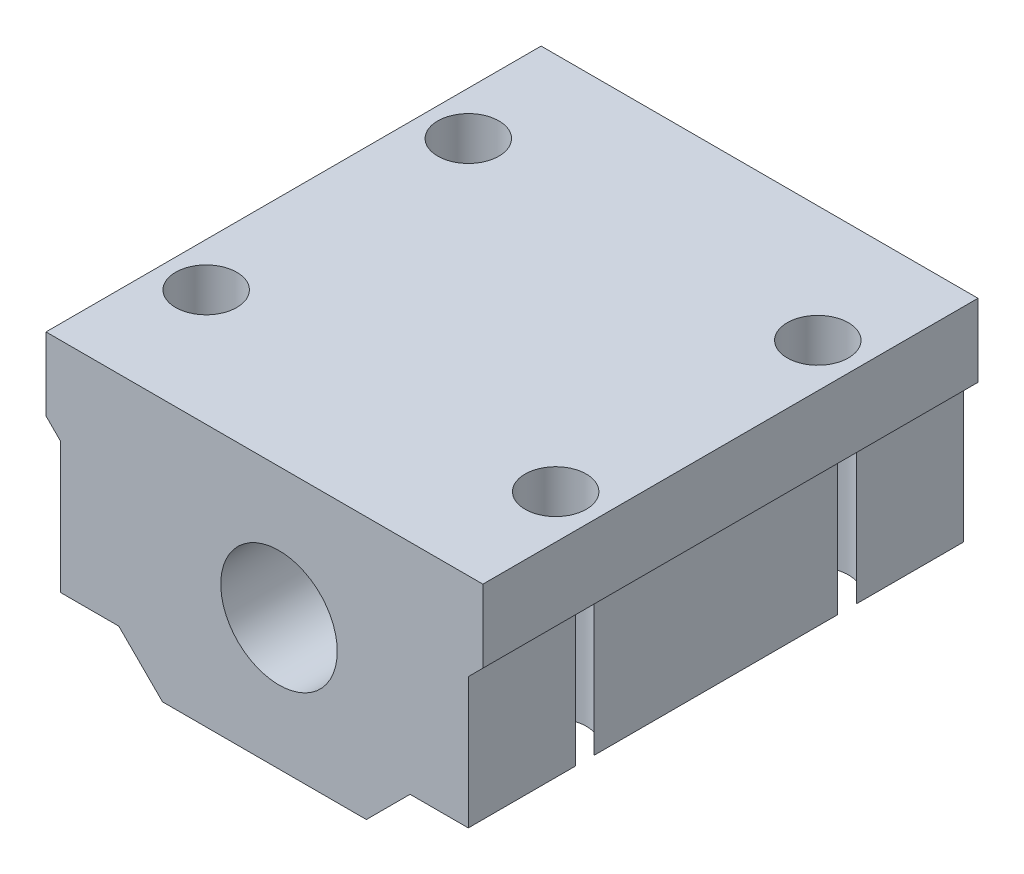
ISO-10303-21;
HEADER;
FILE_DESCRIPTION(('STEP AP214'),'2;1');
FILE_NAME('part.step','',(''),(''),'','','');
FILE_SCHEMA(('AUTOMOTIVE_DESIGN { 1 0 10303 214 1 1 1 1 }'));
ENDSEC;
DATA;
#1=APPLICATION_CONTEXT('core data for automotive mechanical design processes');
#2=APPLICATION_PROTOCOL_DEFINITION('international standard','automotive_design',2000,#1);
#3=PRODUCT_CONTEXT('',#1,'mechanical');
#4=PRODUCT('Part','Part','',(#3));
#5=PRODUCT_RELATED_PRODUCT_CATEGORY('part','',(#4));
#6=PRODUCT_DEFINITION_FORMATION('','',#4);
#7=PRODUCT_DEFINITION_CONTEXT('part definition',#1,'design');
#8=PRODUCT_DEFINITION('design','',#6,#7);
#9=PRODUCT_DEFINITION_SHAPE('','',#8);
#10=(LENGTH_UNIT() NAMED_UNIT(*) SI_UNIT(.MILLI.,.METRE.));
#11=(NAMED_UNIT(*) PLANE_ANGLE_UNIT() SI_UNIT($,.RADIAN.));
#12=(NAMED_UNIT(*) SI_UNIT($,.STERADIAN.) SOLID_ANGLE_UNIT());
#13=UNCERTAINTY_MEASURE_WITH_UNIT(LENGTH_MEASURE(1.E-05),#10,'distance_accuracy_value','');
#14=(GEOMETRIC_REPRESENTATION_CONTEXT(3) GLOBAL_UNCERTAINTY_ASSIGNED_CONTEXT((#13)) GLOBAL_UNIT_ASSIGNED_CONTEXT((#10,
#11,#12)) REPRESENTATION_CONTEXT('',''));
#15=CARTESIAN_POINT('',(0.,0.,0.));
#16=DIRECTION('',(0.,0.,1.));
#17=DIRECTION('',(1.,0.,0.));
#18=AXIS2_PLACEMENT_3D('',#15,#16,#17);
#19=CARTESIAN_POINT('',(0.,-6.,34.));
#20=DIRECTION('',(0.,1.,0.));
#21=DIRECTION('',(-1.,0.,0.));
#22=AXIS2_PLACEMENT_3D('',#19,#20,#21);
#23=PLANE('',#22);
#24=DIRECTION('',(0.,0.,-1.));
#25=VECTOR('',#24,1.);
#26=CARTESIAN_POINT('',(9.,-6.,34.));
#27=LINE('',#26,#25);
#28=CARTESIAN_POINT('',(9.,-6.,34.));
#29=VERTEX_POINT('',#28);
#30=CARTESIAN_POINT('',(9.,-6.,26.6403124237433));
#31=VERTEX_POINT('',#30);
#32=EDGE_CURVE('E212',#29,#31,#27,.T.);
#33=ORIENTED_EDGE('',*,*,#32,.T.);
#34=CARTESIAN_POINT('',(11.,-6.,26.));
#35=DIRECTION('',(0.,1.,0.));
#36=DIRECTION('',(-1.,0.,0.));
#37=AXIS2_PLACEMENT_3D('',#34,#35,#36);
#38=CIRCLE('',#37,2.1);
#39=CARTESIAN_POINT('',(13.,-6.,26.6403124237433));
#40=VERTEX_POINT('',#39);
#41=EDGE_CURVE('E51',#31,#40,#38,.T.);
#42=ORIENTED_EDGE('',*,*,#41,.T.);
#43=DIRECTION('',(0.,0.,-1.));
#44=VECTOR('',#43,1.);
#45=CARTESIAN_POINT('',(13.,-6.,34.));
#46=LINE('',#45,#44);
#47=CARTESIAN_POINT('',(13.,-6.,34.));
#48=VERTEX_POINT('',#47);
#49=EDGE_CURVE('E216',#48,#40,#46,.T.);
#50=ORIENTED_EDGE('',*,*,#49,.F.);
#51=DIRECTION('',(1.,0.,0.));
#52=VECTOR('',#51,1.);
#53=CARTESIAN_POINT('',(0.,-6.,34.));
#54=LINE('',#53,#52);
#55=EDGE_CURVE('E333',#29,#48,#54,.T.);
#56=ORIENTED_EDGE('',*,*,#55,.F.);
#57=EDGE_LOOP('',(#33,#42,#50,#56));
#58=FACE_BOUND('',#57,.T.);
#59=ADVANCED_FACE('F37',(#58),#23,.F.);
#60=CARTESIAN_POINT('',(13.,0.,34.));
#61=DIRECTION('',(1.,0.,0.));
#62=DIRECTION('',(0.,1.,0.));
#63=AXIS2_PLACEMENT_3D('',#60,#61,#62);
#64=PLANE('',#63);
#65=DIRECTION('',(0.,1.,0.));
#66=VECTOR('',#65,1.);
#67=CARTESIAN_POINT('',(13.,-9.,25.3596875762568));
#68=LINE('',#67,#66);
#69=CARTESIAN_POINT('',(13.,-6.,25.3596875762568));
#70=VERTEX_POINT('',#69);
#71=CARTESIAN_POINT('',(13.,3.,25.3596875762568));
#72=VERTEX_POINT('',#71);
#73=EDGE_CURVE('E397',#70,#72,#68,.T.);
#74=ORIENTED_EDGE('',*,*,#73,.F.);
#75=CARTESIAN_POINT('',(13.,-6.,8.64031242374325));
#76=VERTEX_POINT('',#75);
#77=EDGE_CURVE('E207',#70,#76,#46,.T.);
#78=ORIENTED_EDGE('',*,*,#77,.T.);
#79=DIRECTION('',(0.,1.,0.));
#80=VECTOR('',#79,1.);
#81=CARTESIAN_POINT('',(13.,-9.,8.64031242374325));
#82=LINE('',#81,#80);
#83=CARTESIAN_POINT('',(13.,3.,8.64031242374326));
#84=VERTEX_POINT('',#83);
#85=EDGE_CURVE('E265',#84,#76,#82,.F.);
#86=ORIENTED_EDGE('',*,*,#85,.F.);
#87=DIRECTION('',(0.,0.,-1.));
#88=VECTOR('',#87,1.);
#89=CARTESIAN_POINT('',(13.,3.,34.));
#90=LINE('',#89,#88);
#91=EDGE_CURVE('E252',#72,#84,#90,.T.);
#92=ORIENTED_EDGE('',*,*,#91,.F.);
#93=EDGE_LOOP('',(#74,#78,#86,#92));
#94=FACE_BOUND('',#93,.T.);
#95=ADVANCED_FACE('F410',(#94),#64,.T.);
#96=DIRECTION('',(0.,1.,0.));
#97=VECTOR('',#96,1.);
#98=CARTESIAN_POINT('',(13.,-9.,7.35968757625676));
#99=LINE('',#98,#97);
#100=CARTESIAN_POINT('',(13.,-6.,7.35968757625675));
#101=VERTEX_POINT('',#100);
#102=CARTESIAN_POINT('',(13.,3.,7.35968757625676));
#103=VERTEX_POINT('',#102);
#104=EDGE_CURVE('E275',#101,#103,#99,.T.);
#105=ORIENTED_EDGE('',*,*,#104,.F.);
#106=CARTESIAN_POINT('',(13.,-6.,0.));
#107=VERTEX_POINT('',#106);
#108=EDGE_CURVE('E379',#101,#107,#46,.T.);
#109=ORIENTED_EDGE('',*,*,#108,.T.);
#110=DIRECTION('',(0.,-1.,0.));
#111=VECTOR('',#110,1.);
#112=CARTESIAN_POINT('',(13.,0.,0.));
#113=LINE('',#112,#111);
#114=CARTESIAN_POINT('',(13.,3.,0.));
#115=VERTEX_POINT('',#114);
#116=EDGE_CURVE('E343',#115,#107,#113,.T.);
#117=ORIENTED_EDGE('',*,*,#116,.F.);
#118=EDGE_CURVE('E247',#103,#115,#90,.T.);
#119=ORIENTED_EDGE('',*,*,#118,.F.);
#120=EDGE_LOOP('',(#105,#109,#117,#119));
#121=FACE_BOUND('',#120,.T.);
#122=ADVANCED_FACE('F386',(#121),#64,.T.);
#123=ORIENTED_EDGE('',*,*,#77,.F.);
#124=CARTESIAN_POINT('',(9.,-6.,25.3596875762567));
#125=VERTEX_POINT('',#124);
#126=EDGE_CURVE('E197',#70,#125,#38,.T.);
#127=ORIENTED_EDGE('',*,*,#126,.T.);
#128=CARTESIAN_POINT('',(9.,-6.,8.64031242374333));
#129=VERTEX_POINT('',#128);
#130=EDGE_CURVE('E206',#125,#129,#27,.T.);
#131=ORIENTED_EDGE('',*,*,#130,.T.);
#132=CARTESIAN_POINT('',(11.,-6.,8.));
#133=DIRECTION('',(0.,1.,0.));
#134=DIRECTION('',(-1.,0.,0.));
#135=AXIS2_PLACEMENT_3D('',#132,#133,#134);
#136=CIRCLE('',#135,2.1);
#137=EDGE_CURVE('E45',#129,#76,#136,.T.);
#138=ORIENTED_EDGE('',*,*,#137,.T.);
#139=EDGE_LOOP('',(#123,#127,#131,#138));
#140=FACE_BOUND('',#139,.T.);
#141=ADVANCED_FACE('F204',(#140),#23,.F.);
#142=DIRECTION('',(0.,0.,-1.));
#143=VECTOR('',#142,1.);
#144=CARTESIAN_POINT('',(-15.,-6.,34.));
#145=LINE('',#144,#143);
#146=CARTESIAN_POINT('',(-15.,-6.,34.));
#147=VERTEX_POINT('',#146);
#148=CARTESIAN_POINT('',(-15.,-6.,26.6403124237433));
#149=VERTEX_POINT('',#148);
#150=EDGE_CURVE('E230',#147,#149,#145,.T.);
#151=ORIENTED_EDGE('',*,*,#150,.T.);
#152=CARTESIAN_POINT('',(-13.,-6.,26.));
#153=DIRECTION('',(0.,1.,0.));
#154=DIRECTION('',(-1.,0.,0.));
#155=AXIS2_PLACEMENT_3D('',#152,#153,#154);
#156=CIRCLE('',#155,2.1);
#157=CARTESIAN_POINT('',(-11.,-6.,26.6403124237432));
#158=VERTEX_POINT('',#157);
#159=EDGE_CURVE('E281',#149,#158,#156,.T.);
#160=ORIENTED_EDGE('',*,*,#159,.T.);
#161=DIRECTION('',(0.,0.,-1.));
#162=VECTOR('',#161,1.);
#163=CARTESIAN_POINT('',(-11.,-6.,34.));
#164=LINE('',#163,#162);
#165=CARTESIAN_POINT('',(-11.,-6.,34.));
#166=VERTEX_POINT('',#165);
#167=EDGE_CURVE('E225',#166,#158,#164,.T.);
#168=ORIENTED_EDGE('',*,*,#167,.F.);
#169=EDGE_CURVE('E329',#147,#166,#54,.T.);
#170=ORIENTED_EDGE('',*,*,#169,.F.);
#171=EDGE_LOOP('',(#151,#160,#168,#170));
#172=FACE_BOUND('',#171,.T.);
#173=ADVANCED_FACE('F428',(#172),#23,.F.);
#174=CARTESIAN_POINT('',(-15.,0.,34.));
#175=DIRECTION('',(1.,0.,0.));
#176=DIRECTION('',(0.,1.,0.));
#177=AXIS2_PLACEMENT_3D('',#174,#175,#176);
#178=PLANE('',#177);
#179=CARTESIAN_POINT('',(-15.,-6.,25.3596875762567));
#180=VERTEX_POINT('',#179);
#181=CARTESIAN_POINT('',(-15.,-6.,8.64031242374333));
#182=VERTEX_POINT('',#181);
#183=EDGE_CURVE('E234',#180,#182,#145,.T.);
#184=ORIENTED_EDGE('',*,*,#183,.F.);
#185=DIRECTION('',(0.,1.,0.));
#186=VECTOR('',#185,1.);
#187=CARTESIAN_POINT('',(-15.,-9.,25.3596875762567));
#188=LINE('',#187,#186);
#189=CARTESIAN_POINT('',(-15.,3.,25.3596875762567));
#190=VERTEX_POINT('',#189);
#191=EDGE_CURVE('E285',#180,#190,#188,.T.);
#192=ORIENTED_EDGE('',*,*,#191,.T.);
#193=DIRECTION('',(0.,0.,-1.));
#194=VECTOR('',#193,1.);
#195=CARTESIAN_POINT('',(-15.,3.,34.));
#196=LINE('',#195,#194);
#197=CARTESIAN_POINT('',(-15.,3.,8.64031242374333));
#198=VERTEX_POINT('',#197);
#199=EDGE_CURVE('E239',#190,#198,#196,.T.);
#200=ORIENTED_EDGE('',*,*,#199,.T.);
#201=DIRECTION('',(0.,1.,0.));
#202=VECTOR('',#201,1.);
#203=CARTESIAN_POINT('',(-15.,-9.,8.64031242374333));
#204=LINE('',#203,#202);
#205=EDGE_CURVE('E297',#198,#182,#204,.F.);
#206=ORIENTED_EDGE('',*,*,#205,.T.);
#207=EDGE_LOOP('',(#184,#192,#200,#206));
#208=FACE_BOUND('',#207,.T.);
#209=ADVANCED_FACE('F432',(#208),#178,.F.);
#210=CARTESIAN_POINT('',(-15.,-6.,7.35968757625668));
#211=VERTEX_POINT('',#210);
#212=CARTESIAN_POINT('',(-15.,-6.,0.));
#213=VERTEX_POINT('',#212);
#214=EDGE_CURVE('E228',#211,#213,#145,.T.);
#215=ORIENTED_EDGE('',*,*,#214,.F.);
#216=DIRECTION('',(0.,1.,0.));
#217=VECTOR('',#216,1.);
#218=CARTESIAN_POINT('',(-15.,-9.,7.35968757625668));
#219=LINE('',#218,#217);
#220=CARTESIAN_POINT('',(-15.,3.,7.35968757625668));
#221=VERTEX_POINT('',#220);
#222=EDGE_CURVE('E300',#211,#221,#219,.T.);
#223=ORIENTED_EDGE('',*,*,#222,.T.);
#224=CARTESIAN_POINT('',(-15.,3.,0.));
#225=VERTEX_POINT('',#224);
#226=EDGE_CURVE('E233',#221,#225,#196,.T.);
#227=ORIENTED_EDGE('',*,*,#226,.T.);
#228=DIRECTION('',(0.,-1.,0.));
#229=VECTOR('',#228,1.);
#230=CARTESIAN_POINT('',(-15.,0.,0.));
#231=LINE('',#230,#229);
#232=EDGE_CURVE('E361',#225,#213,#231,.T.);
#233=ORIENTED_EDGE('',*,*,#232,.T.);
#234=EDGE_LOOP('',(#215,#223,#227,#233));
#235=FACE_BOUND('',#234,.T.);
#236=ADVANCED_FACE('F425',(#235),#178,.F.);
#237=CARTESIAN_POINT('',(-11.,-6.,25.3596875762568));
#238=VERTEX_POINT('',#237);
#239=CARTESIAN_POINT('',(-11.,-6.,8.64031242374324));
#240=VERTEX_POINT('',#239);
#241=EDGE_CURVE('E229',#238,#240,#164,.T.);
#242=ORIENTED_EDGE('',*,*,#241,.F.);
#243=EDGE_CURVE('E273',#238,#180,#156,.T.);
#244=ORIENTED_EDGE('',*,*,#243,.T.);
#245=ORIENTED_EDGE('',*,*,#183,.T.);
#246=CARTESIAN_POINT('',(-13.,-6.,8.));
#247=DIRECTION('',(0.,1.,0.));
#248=DIRECTION('',(-1.,0.,0.));
#249=AXIS2_PLACEMENT_3D('',#246,#247,#248);
#250=CIRCLE('',#249,2.1);
#251=EDGE_CURVE('E296',#182,#240,#250,.T.);
#252=ORIENTED_EDGE('',*,*,#251,.T.);
#253=EDGE_LOOP('',(#242,#244,#245,#252));
#254=FACE_BOUND('',#253,.T.);
#255=ADVANCED_FACE('F419',(#254),#23,.F.);
#256=DIRECTION('',(0.,1.,0.));
#257=VECTOR('',#256,1.);
#258=CARTESIAN_POINT('',(13.,-9.,26.6403124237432));
#259=LINE('',#258,#257);
#260=CARTESIAN_POINT('',(13.,3.,26.6403124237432));
#261=VERTEX_POINT('',#260);
#262=EDGE_CURVE('E392',#261,#40,#259,.F.);
#263=ORIENTED_EDGE('',*,*,#262,.F.);
#264=CARTESIAN_POINT('',(13.,3.,34.));
#265=VERTEX_POINT('',#264);
#266=EDGE_CURVE('E248',#265,#261,#90,.T.);
#267=ORIENTED_EDGE('',*,*,#266,.F.);
#268=DIRECTION('',(0.,-1.,0.));
#269=VECTOR('',#268,1.);
#270=CARTESIAN_POINT('',(13.,0.,34.));
#271=LINE('',#270,#269);
#272=EDGE_CURVE('E309',#265,#48,#271,.T.);
#273=ORIENTED_EDGE('',*,*,#272,.T.);
#274=ORIENTED_EDGE('',*,*,#49,.T.);
#275=EDGE_LOOP('',(#263,#267,#273,#274));
#276=FACE_BOUND('',#275,.T.);
#277=ADVANCED_FACE('F391',(#276),#64,.T.);
#278=CARTESIAN_POINT('',(5.00000000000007,-5.00000000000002,34.));
#279=DIRECTION('',(-0.707106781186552,0.707106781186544,0.));
#280=DIRECTION('',(-0.707106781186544,-0.707106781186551,0.));
#281=AXIS2_PLACEMENT_3D('',#278,#279,#280);
#282=PLANE('',#281);
#283=ORIENTED_EDGE('',*,*,#266,.T.);
#284=CARTESIAN_POINT('',(11.,0.99999999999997,26.));
#285=DIRECTION('',(-0.707106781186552,0.707106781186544,0.));
#286=DIRECTION('',(0.707106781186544,0.707106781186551,0.));
#287=AXIS2_PLACEMENT_3D('',#284,#285,#286);
#288=ELLIPSE('',#287,2.96984848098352,2.1);
#289=EDGE_CURVE('E402',#261,#72,#288,.T.);
#290=ORIENTED_EDGE('',*,*,#289,.T.);
#291=ORIENTED_EDGE('',*,*,#91,.T.);
#292=CARTESIAN_POINT('',(11.,0.99999999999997,8.));
#293=DIRECTION('',(-0.707106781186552,0.707106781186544,0.));
#294=DIRECTION('',(0.707106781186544,0.707106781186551,0.));
#295=AXIS2_PLACEMENT_3D('',#292,#293,#294);
#296=ELLIPSE('',#295,2.96984848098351,2.1);
#297=EDGE_CURVE('E267',#84,#103,#296,.T.);
#298=ORIENTED_EDGE('',*,*,#297,.T.);
#299=ORIENTED_EDGE('',*,*,#118,.T.);
#300=DIRECTION('',(0.707106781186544,0.707106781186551,0.));
#301=VECTOR('',#300,1.);
#302=CARTESIAN_POINT('',(5.00000000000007,-5.00000000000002,0.));
#303=LINE('',#302,#301);
#304=CARTESIAN_POINT('',(14.,4.,0.));
#305=VERTEX_POINT('',#304);
#306=EDGE_CURVE('E346',#115,#305,#303,.T.);
#307=ORIENTED_EDGE('',*,*,#306,.T.);
#308=DIRECTION('',(0.,0.,-1.));
#309=VECTOR('',#308,1.);
#310=CARTESIAN_POINT('',(14.,4.,34.));
#311=LINE('',#310,#309);
#312=CARTESIAN_POINT('',(14.,4.,34.));
#313=VERTEX_POINT('',#312);
#314=EDGE_CURVE('E245',#313,#305,#311,.T.);
#315=ORIENTED_EDGE('',*,*,#314,.F.);
#316=DIRECTION('',(0.707106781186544,0.707106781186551,0.));
#317=VECTOR('',#316,1.);
#318=CARTESIAN_POINT('',(5.00000000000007,-5.00000000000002,34.));
#319=LINE('',#318,#317);
#320=EDGE_CURVE('E313',#265,#313,#319,.T.);
#321=ORIENTED_EDGE('',*,*,#320,.F.);
#322=EDGE_LOOP('',(#283,#290,#291,#298,#299,#307,#315,#321));
#323=FACE_BOUND('',#322,.T.);
#324=ADVANCED_FACE('F409',(#323),#282,.F.);
#325=CARTESIAN_POINT('',(14.,0.,34.));
#326=DIRECTION('',(1.,0.,0.));
#327=DIRECTION('',(0.,0.,-1.));
#328=AXIS2_PLACEMENT_3D('',#325,#326,#327);
#329=PLANE('',#328);
#330=DIRECTION('',(0.,-1.,0.));
#331=VECTOR('',#330,1.);
#332=CARTESIAN_POINT('',(14.,0.,0.));
#333=LINE('',#332,#331);
#334=CARTESIAN_POINT('',(14.,9.,0.));
#335=VERTEX_POINT('',#334);
#336=EDGE_CURVE('E349',#335,#305,#333,.T.);
#337=ORIENTED_EDGE('',*,*,#336,.F.);
#338=DIRECTION('',(0.,0.,-1.));
#339=VECTOR('',#338,1.);
#340=CARTESIAN_POINT('',(14.,9.,34.));
#341=LINE('',#340,#339);
#342=CARTESIAN_POINT('',(14.,9.,34.));
#343=VERTEX_POINT('',#342);
#344=EDGE_CURVE('E243',#343,#335,#341,.T.);
#345=ORIENTED_EDGE('',*,*,#344,.F.);
#346=DIRECTION('',(0.,-1.,0.));
#347=VECTOR('',#346,1.);
#348=CARTESIAN_POINT('',(14.,0.,34.));
#349=LINE('',#348,#347);
#350=EDGE_CURVE('E315',#343,#313,#349,.T.);
#351=ORIENTED_EDGE('',*,*,#350,.T.);
#352=ORIENTED_EDGE('',*,*,#314,.T.);
#353=EDGE_LOOP('',(#337,#345,#351,#352));
#354=FACE_BOUND('',#353,.T.);
#355=ADVANCED_FACE('F424',(#354),#329,.T.);
#356=CARTESIAN_POINT('',(0.,9.,34.));
#357=DIRECTION('',(0.,1.,0.));
#358=DIRECTION('',(0.,0.,1.));
#359=AXIS2_PLACEMENT_3D('',#356,#357,#358);
#360=PLANE('',#359);
#361=CARTESIAN_POINT('',(11.,9.,26.));
#362=DIRECTION('',(0.,1.,0.));
#363=DIRECTION('',(0.,0.,1.));
#364=AXIS2_PLACEMENT_3D('',#361,#362,#363);
#365=CIRCLE('',#364,2.1);
#366=CARTESIAN_POINT('',(11.,9.,28.1));
#367=VERTEX_POINT('',#366);
#368=EDGE_CURVE('E208',#367,#367,#365,.T.);
#369=ORIENTED_EDGE('',*,*,#368,.F.);
#370=EDGE_LOOP('',(#369));
#371=FACE_BOUND('',#370,.T.);
#372=CARTESIAN_POINT('',(11.,9.,8.));
#373=DIRECTION('',(0.,1.,0.));
#374=DIRECTION('',(0.,0.,1.));
#375=AXIS2_PLACEMENT_3D('',#372,#373,#374);
#376=CIRCLE('',#375,2.1);
#377=CARTESIAN_POINT('',(11.,9.,10.1));
#378=VERTEX_POINT('',#377);
#379=EDGE_CURVE('E405',#378,#378,#376,.T.);
#380=ORIENTED_EDGE('',*,*,#379,.F.);
#381=EDGE_LOOP('',(#380));
#382=FACE_BOUND('',#381,.T.);
#383=CARTESIAN_POINT('',(-13.,9.,26.));
#384=DIRECTION('',(0.,1.,0.));
#385=DIRECTION('',(0.,0.,1.));
#386=AXIS2_PLACEMENT_3D('',#383,#384,#385);
#387=CIRCLE('',#386,2.1);
#388=CARTESIAN_POINT('',(-13.,9.,28.1));
#389=VERTEX_POINT('',#388);
#390=EDGE_CURVE('E270',#389,#389,#387,.T.);
#391=ORIENTED_EDGE('',*,*,#390,.F.);
#392=EDGE_LOOP('',(#391));
#393=FACE_BOUND('',#392,.T.);
#394=CARTESIAN_POINT('',(-13.,9.,8.));
#395=DIRECTION('',(0.,1.,0.));
#396=DIRECTION('',(0.,0.,1.));
#397=AXIS2_PLACEMENT_3D('',#394,#395,#396);
#398=CIRCLE('',#397,2.1);
#399=CARTESIAN_POINT('',(-13.,9.,10.1));
#400=VERTEX_POINT('',#399);
#401=EDGE_CURVE('E290',#400,#400,#398,.T.);
#402=ORIENTED_EDGE('',*,*,#401,.F.);
#403=EDGE_LOOP('',(#402));
#404=FACE_BOUND('',#403,.T.);
#405=DIRECTION('',(1.,0.,0.));
#406=VECTOR('',#405,1.);
#407=CARTESIAN_POINT('',(0.,9.,0.));
#408=LINE('',#407,#406);
#409=CARTESIAN_POINT('',(-16.,9.,0.));
#410=VERTEX_POINT('',#409);
#411=EDGE_CURVE('E352',#410,#335,#408,.T.);
#412=ORIENTED_EDGE('',*,*,#411,.F.);
#413=DIRECTION('',(0.,0.,-1.));
#414=VECTOR('',#413,1.);
#415=CARTESIAN_POINT('',(-16.,9.,34.));
#416=LINE('',#415,#414);
#417=CARTESIAN_POINT('',(-16.,9.,34.));
#418=VERTEX_POINT('',#417);
#419=EDGE_CURVE('E241',#418,#410,#416,.T.);
#420=ORIENTED_EDGE('',*,*,#419,.F.);
#421=DIRECTION('',(1.,0.,0.));
#422=VECTOR('',#421,1.);
#423=CARTESIAN_POINT('',(0.,9.,34.));
#424=LINE('',#423,#422);
#425=EDGE_CURVE('E318',#418,#343,#424,.T.);
#426=ORIENTED_EDGE('',*,*,#425,.T.);
#427=ORIENTED_EDGE('',*,*,#344,.T.);
#428=EDGE_LOOP('',(#412,#420,#426,#427));
#429=FACE_BOUND('',#428,.T.);
#430=ADVANCED_FACE('F477',(#371,#382,#393,#404,#429),#360,.T.);
#431=CARTESIAN_POINT('',(-16.,0.,34.));
#432=DIRECTION('',(1.,0.,0.));
#433=DIRECTION('',(0.,0.,-1.));
#434=AXIS2_PLACEMENT_3D('',#431,#432,#433);
#435=PLANE('',#434);
#436=DIRECTION('',(0.,-1.,0.));
#437=VECTOR('',#436,1.);
#438=CARTESIAN_POINT('',(-16.,0.,0.));
#439=LINE('',#438,#437);
#440=CARTESIAN_POINT('',(-16.,4.00000000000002,0.));
#441=VERTEX_POINT('',#440);
#442=EDGE_CURVE('E355',#410,#441,#439,.T.);
#443=ORIENTED_EDGE('',*,*,#442,.T.);
#444=DIRECTION('',(0.,0.,-1.));
#445=VECTOR('',#444,1.);
#446=CARTESIAN_POINT('',(-16.,4.00000000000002,34.));
#447=LINE('',#446,#445);
#448=CARTESIAN_POINT('',(-16.,4.00000000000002,34.));
#449=VERTEX_POINT('',#448);
#450=EDGE_CURVE('E238',#449,#441,#447,.T.);
#451=ORIENTED_EDGE('',*,*,#450,.F.);
#452=DIRECTION('',(0.,-1.,0.));
#453=VECTOR('',#452,1.);
#454=CARTESIAN_POINT('',(-16.,0.,34.));
#455=LINE('',#454,#453);
#456=EDGE_CURVE('E321',#418,#449,#455,.T.);
#457=ORIENTED_EDGE('',*,*,#456,.F.);
#458=ORIENTED_EDGE('',*,*,#419,.T.);
#459=EDGE_LOOP('',(#443,#451,#457,#458));
#460=FACE_BOUND('',#459,.T.);
#461=ADVANCED_FACE('F474',(#460),#435,.F.);
#462=CARTESIAN_POINT('',(-6.0000000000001,-6.00000000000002,34.));
#463=DIRECTION('',(-0.707106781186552,-0.707106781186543,0.));
#464=DIRECTION('',(0.707106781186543,-0.707106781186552,0.));
#465=AXIS2_PLACEMENT_3D('',#462,#463,#464);
#466=PLANE('',#465);
#467=CARTESIAN_POINT('',(-13.,0.999999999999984,26.));
#468=DIRECTION('',(-0.707106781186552,-0.707106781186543,0.));
#469=DIRECTION('',(-0.707106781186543,0.707106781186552,0.));
#470=AXIS2_PLACEMENT_3D('',#467,#468,#469);
#471=ELLIPSE('',#470,2.96984848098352,2.1);
#472=CARTESIAN_POINT('',(-15.,3.,26.6403124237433));
#473=VERTEX_POINT('',#472);
#474=EDGE_CURVE('E288',#473,#190,#471,.T.);
#475=ORIENTED_EDGE('',*,*,#474,.F.);
#476=CARTESIAN_POINT('',(-15.,3.,34.));
#477=VERTEX_POINT('',#476);
#478=EDGE_CURVE('E235',#477,#473,#196,.T.);
#479=ORIENTED_EDGE('',*,*,#478,.F.);
#480=DIRECTION('',(-0.707106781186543,0.707106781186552,0.));
#481=VECTOR('',#480,1.);
#482=CARTESIAN_POINT('',(-6.0000000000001,-6.00000000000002,34.));
#483=LINE('',#482,#481);
#484=EDGE_CURVE('E323',#477,#449,#483,.T.);
#485=ORIENTED_EDGE('',*,*,#484,.T.);
#486=ORIENTED_EDGE('',*,*,#450,.T.);
#487=DIRECTION('',(-0.707106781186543,0.707106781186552,0.));
#488=VECTOR('',#487,1.);
#489=CARTESIAN_POINT('',(-6.0000000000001,-6.00000000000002,0.));
#490=LINE('',#489,#488);
#491=EDGE_CURVE('E358',#225,#441,#490,.T.);
#492=ORIENTED_EDGE('',*,*,#491,.F.);
#493=ORIENTED_EDGE('',*,*,#226,.F.);
#494=CARTESIAN_POINT('',(-13.,0.999999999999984,8.));
#495=DIRECTION('',(-0.707106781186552,-0.707106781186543,0.));
#496=DIRECTION('',(-0.707106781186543,0.707106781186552,0.));
#497=AXIS2_PLACEMENT_3D('',#494,#495,#496);
#498=ELLIPSE('',#497,2.96984848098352,2.1);
#499=EDGE_CURVE('E303',#198,#221,#498,.T.);
#500=ORIENTED_EDGE('',*,*,#499,.F.);
#501=ORIENTED_EDGE('',*,*,#199,.F.);
#502=EDGE_LOOP('',(#475,#479,#485,#486,#492,#493,#500,#501));
#503=FACE_BOUND('',#502,.T.);
#504=ADVANCED_FACE('F461',(#503),#466,.T.);
#505=ORIENTED_EDGE('',*,*,#478,.T.);
#506=DIRECTION('',(0.,1.,0.));
#507=VECTOR('',#506,1.);
#508=CARTESIAN_POINT('',(-15.,-9.,26.6403124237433));
#509=LINE('',#508,#507);
#510=EDGE_CURVE('E282',#473,#149,#509,.F.);
#511=ORIENTED_EDGE('',*,*,#510,.T.);
#512=ORIENTED_EDGE('',*,*,#150,.F.);
#513=DIRECTION('',(0.,-1.,0.));
#514=VECTOR('',#513,1.);
#515=CARTESIAN_POINT('',(-15.,0.,34.));
#516=LINE('',#515,#514);
#517=EDGE_CURVE('E326',#477,#147,#516,.T.);
#518=ORIENTED_EDGE('',*,*,#517,.F.);
#519=EDGE_LOOP('',(#505,#511,#512,#518));
#520=FACE_BOUND('',#519,.T.);
#521=ADVANCED_FACE('F435',(#520),#178,.F.);
#522=CARTESIAN_POINT('',(-11.,-6.,7.35968757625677));
#523=VERTEX_POINT('',#522);
#524=CARTESIAN_POINT('',(-11.,-6.,0.));
#525=VERTEX_POINT('',#524);
#526=EDGE_CURVE('E224',#523,#525,#164,.T.);
#527=ORIENTED_EDGE('',*,*,#526,.F.);
#528=EDGE_CURVE('E293',#523,#211,#250,.T.);
#529=ORIENTED_EDGE('',*,*,#528,.T.);
#530=ORIENTED_EDGE('',*,*,#214,.T.);
#531=DIRECTION('',(1.,0.,0.));
#532=VECTOR('',#531,1.);
#533=CARTESIAN_POINT('',(0.,-6.,0.));
#534=LINE('',#533,#532);
#535=EDGE_CURVE('E364',#213,#525,#534,.T.);
#536=ORIENTED_EDGE('',*,*,#535,.T.);
#537=EDGE_LOOP('',(#527,#529,#530,#536));
#538=FACE_BOUND('',#537,.T.);
#539=ADVANCED_FACE('F427',(#538),#23,.F.);
#540=CARTESIAN_POINT('',(-8.50000000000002,-8.49999999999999,34.));
#541=DIRECTION('',(0.707106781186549,0.707106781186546,0.));
#542=DIRECTION('',(-0.707106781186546,0.707106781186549,0.));
#543=AXIS2_PLACEMENT_3D('',#540,#541,#542);
#544=PLANE('',#543);
#545=ORIENTED_EDGE('',*,*,#167,.T.);
#546=CARTESIAN_POINT('',(-13.,-3.99999999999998,26.));
#547=DIRECTION('',(0.707106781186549,0.707106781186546,0.));
#548=DIRECTION('',(-0.707106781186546,0.707106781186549,0.));
#549=AXIS2_PLACEMENT_3D('',#546,#547,#548);
#550=ELLIPSE('',#549,2.9698484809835,2.1);
#551=EDGE_CURVE('E255',#158,#238,#550,.T.);
#552=ORIENTED_EDGE('',*,*,#551,.T.);
#553=ORIENTED_EDGE('',*,*,#241,.T.);
#554=CARTESIAN_POINT('',(-13.,-3.99999999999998,8.));
#555=DIRECTION('',(0.707106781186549,0.707106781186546,0.));
#556=DIRECTION('',(-0.707106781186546,0.707106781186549,0.));
#557=AXIS2_PLACEMENT_3D('',#554,#555,#556);
#558=ELLIPSE('',#557,2.9698484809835,2.1);
#559=EDGE_CURVE('E251',#240,#523,#558,.T.);
#560=ORIENTED_EDGE('',*,*,#559,.T.);
#561=ORIENTED_EDGE('',*,*,#526,.T.);
#562=DIRECTION('',(0.707106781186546,-0.707106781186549,0.));
#563=VECTOR('',#562,1.);
#564=CARTESIAN_POINT('',(-8.50000000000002,-8.49999999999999,0.));
#565=LINE('',#564,#563);
#566=CARTESIAN_POINT('',(-8.00000000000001,-9.,0.));
#567=VERTEX_POINT('',#566);
#568=EDGE_CURVE('E367',#525,#567,#565,.T.);
#569=ORIENTED_EDGE('',*,*,#568,.T.);
#570=DIRECTION('',(0.,0.,-1.));
#571=VECTOR('',#570,1.);
#572=CARTESIAN_POINT('',(-8.00000000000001,-9.,34.));
#573=LINE('',#572,#571);
#574=CARTESIAN_POINT('',(-8.00000000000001,-9.,34.));
#575=VERTEX_POINT('',#574);
#576=EDGE_CURVE('E221',#575,#567,#573,.T.);
#577=ORIENTED_EDGE('',*,*,#576,.F.);
#578=DIRECTION('',(0.707106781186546,-0.707106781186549,0.));
#579=VECTOR('',#578,1.);
#580=CARTESIAN_POINT('',(-8.50000000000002,-8.49999999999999,34.));
#581=LINE('',#580,#579);
#582=EDGE_CURVE('E332',#166,#575,#581,.T.);
#583=ORIENTED_EDGE('',*,*,#582,.F.);
#584=EDGE_LOOP('',(#545,#552,#553,#560,#561,#569,#577,#583));
#585=FACE_BOUND('',#584,.T.);
#586=ADVANCED_FACE('F440',(#585),#544,.F.);
#587=CARTESIAN_POINT('',(0.,-9.,34.));
#588=DIRECTION('',(0.,1.,0.));
#589=DIRECTION('',(-1.,0.,0.));
#590=AXIS2_PLACEMENT_3D('',#587,#588,#589);
#591=PLANE('',#590);
#592=DIRECTION('',(1.,0.,0.));
#593=VECTOR('',#592,1.);
#594=CARTESIAN_POINT('',(0.,-9.,0.));
#595=LINE('',#594,#593);
#596=CARTESIAN_POINT('',(5.99999999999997,-9.,0.));
#597=VERTEX_POINT('',#596);
#598=EDGE_CURVE('E370',#567,#597,#595,.T.);
#599=ORIENTED_EDGE('',*,*,#598,.T.);
#600=DIRECTION('',(0.,0.,-1.));
#601=VECTOR('',#600,1.);
#602=CARTESIAN_POINT('',(5.99999999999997,-9.,34.));
#603=LINE('',#602,#601);
#604=CARTESIAN_POINT('',(5.99999999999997,-9.,34.));
#605=VERTEX_POINT('',#604);
#606=EDGE_CURVE('E215',#605,#597,#603,.T.);
#607=ORIENTED_EDGE('',*,*,#606,.F.);
#608=DIRECTION('',(1.,0.,0.));
#609=VECTOR('',#608,1.);
#610=CARTESIAN_POINT('',(0.,-9.,34.));
#611=LINE('',#610,#609);
#612=EDGE_CURVE('E336',#575,#605,#611,.T.);
#613=ORIENTED_EDGE('',*,*,#612,.F.);
#614=ORIENTED_EDGE('',*,*,#576,.T.);
#615=EDGE_LOOP('',(#599,#607,#613,#614));
#616=FACE_BOUND('',#615,.T.);
#617=ADVANCED_FACE('F488',(#616),#591,.F.);
#618=CARTESIAN_POINT('',(7.49999999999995,-7.50000000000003,34.));
#619=DIRECTION('',(0.707106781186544,-0.707106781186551,0.));
#620=DIRECTION('',(0.707106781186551,0.707106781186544,0.));
#621=AXIS2_PLACEMENT_3D('',#618,#619,#620);
#622=PLANE('',#621);
#623=CARTESIAN_POINT('',(11.,-4.00000000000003,26.));
#624=DIRECTION('',(0.707106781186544,-0.707106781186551,0.));
#625=DIRECTION('',(0.707106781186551,0.707106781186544,0.));
#626=AXIS2_PLACEMENT_3D('',#623,#624,#625);
#627=ELLIPSE('',#626,2.96984848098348,2.1);
#628=EDGE_CURVE('E11',#31,#125,#627,.T.);
#629=ORIENTED_EDGE('',*,*,#628,.F.);
#630=ORIENTED_EDGE('',*,*,#32,.F.);
#631=DIRECTION('',(-0.707106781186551,-0.707106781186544,0.));
#632=VECTOR('',#631,1.);
#633=CARTESIAN_POINT('',(7.49999999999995,-7.50000000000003,34.));
#634=LINE('',#633,#632);
#635=EDGE_CURVE('E338',#29,#605,#634,.T.);
#636=ORIENTED_EDGE('',*,*,#635,.T.);
#637=ORIENTED_EDGE('',*,*,#606,.T.);
#638=DIRECTION('',(-0.707106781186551,-0.707106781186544,0.));
#639=VECTOR('',#638,1.);
#640=CARTESIAN_POINT('',(7.49999999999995,-7.50000000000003,0.));
#641=LINE('',#640,#639);
#642=CARTESIAN_POINT('',(9.,-6.,0.));
#643=VERTEX_POINT('',#642);
#644=EDGE_CURVE('E372',#643,#597,#641,.T.);
#645=ORIENTED_EDGE('',*,*,#644,.F.);
#646=CARTESIAN_POINT('',(9.,-6.,7.35968757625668));
#647=VERTEX_POINT('',#646);
#648=EDGE_CURVE('E213',#647,#643,#27,.T.);
#649=ORIENTED_EDGE('',*,*,#648,.F.);
#650=CARTESIAN_POINT('',(11.,-4.00000000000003,8.));
#651=DIRECTION('',(0.707106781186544,-0.707106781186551,0.));
#652=DIRECTION('',(0.707106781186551,0.707106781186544,0.));
#653=AXIS2_PLACEMENT_3D('',#650,#651,#652);
#654=ELLIPSE('',#653,2.96984848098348,2.1);
#655=EDGE_CURVE('E59',#129,#647,#654,.T.);
#656=ORIENTED_EDGE('',*,*,#655,.F.);
#657=ORIENTED_EDGE('',*,*,#130,.F.);
#658=EDGE_LOOP('',(#629,#630,#636,#637,#645,#649,#656,#657));
#659=FACE_BOUND('',#658,.T.);
#660=ADVANCED_FACE('F210',(#659),#622,.T.);
#661=CARTESIAN_POINT('',(0.,0.,34.));
#662=DIRECTION('',(0.,0.,-1.));
#663=DIRECTION('',(-1.,0.,0.));
#664=AXIS2_PLACEMENT_3D('',#661,#662,#663);
#665=CYLINDRICAL_SURFACE('',#664,4.);
#666=CARTESIAN_POINT('',(0.,0.,34.));
#667=DIRECTION('',(0.,0.,1.));
#668=DIRECTION('',(1.,0.,0.));
#669=AXIS2_PLACEMENT_3D('',#666,#667,#668);
#670=CIRCLE('',#669,4.);
#671=CARTESIAN_POINT('',(4.,0.,34.));
#672=VERTEX_POINT('',#671);
#673=EDGE_CURVE('E306',#672,#672,#670,.T.);
#674=ORIENTED_EDGE('',*,*,#673,.T.);
#675=EDGE_LOOP('',(#674));
#676=FACE_BOUND('',#675,.T.);
#677=CARTESIAN_POINT('',(0.,0.,0.));
#678=DIRECTION('',(0.,0.,1.));
#679=DIRECTION('',(1.,0.,0.));
#680=AXIS2_PLACEMENT_3D('',#677,#678,#679);
#681=CIRCLE('',#680,4.);
#682=CARTESIAN_POINT('',(4.,0.,0.));
#683=VERTEX_POINT('',#682);
#684=EDGE_CURVE('E305',#683,#683,#681,.T.);
#685=ORIENTED_EDGE('',*,*,#684,.F.);
#686=EDGE_LOOP('',(#685));
#687=FACE_BOUND('',#686,.T.);
#688=ADVANCED_FACE('F39',(#676,#687),#665,.F.);
#689=ORIENTED_EDGE('',*,*,#108,.F.);
#690=EDGE_CURVE('E257',#101,#647,#136,.T.);
#691=ORIENTED_EDGE('',*,*,#690,.T.);
#692=ORIENTED_EDGE('',*,*,#648,.T.);
#693=EDGE_CURVE('E310',#643,#107,#534,.T.);
#694=ORIENTED_EDGE('',*,*,#693,.T.);
#695=EDGE_LOOP('',(#689,#691,#692,#694));
#696=FACE_BOUND('',#695,.T.);
#697=ADVANCED_FACE('F378',(#696),#23,.F.);
#698=CARTESIAN_POINT('',(0.,0.,34.));
#699=DIRECTION('',(0.,0.,1.));
#700=DIRECTION('',(1.,0.,0.));
#701=AXIS2_PLACEMENT_3D('',#698,#699,#700);
#702=PLANE('',#701);
#703=ORIENTED_EDGE('',*,*,#673,.F.);
#704=EDGE_LOOP('',(#703));
#705=FACE_BOUND('',#704,.T.);
#706=ORIENTED_EDGE('',*,*,#272,.F.);
#707=ORIENTED_EDGE('',*,*,#320,.T.);
#708=ORIENTED_EDGE('',*,*,#350,.F.);
#709=ORIENTED_EDGE('',*,*,#425,.F.);
#710=ORIENTED_EDGE('',*,*,#456,.T.);
#711=ORIENTED_EDGE('',*,*,#484,.F.);
#712=ORIENTED_EDGE('',*,*,#517,.T.);
#713=ORIENTED_EDGE('',*,*,#169,.T.);
#714=ORIENTED_EDGE('',*,*,#582,.T.);
#715=ORIENTED_EDGE('',*,*,#612,.T.);
#716=ORIENTED_EDGE('',*,*,#635,.F.);
#717=ORIENTED_EDGE('',*,*,#55,.T.);
#718=EDGE_LOOP('',(#706,#707,#708,#709,#710,#711,#712,#713,#714,#715,#716,#717));
#719=FACE_BOUND('',#718,.T.);
#720=ADVANCED_FACE('F485',(#705,#719),#702,.T.);
#721=CARTESIAN_POINT('',(0.,0.,0.));
#722=DIRECTION('',(0.,0.,1.));
#723=DIRECTION('',(1.,0.,0.));
#724=AXIS2_PLACEMENT_3D('',#721,#722,#723);
#725=PLANE('',#724);
#726=ORIENTED_EDGE('',*,*,#684,.T.);
#727=EDGE_LOOP('',(#726));
#728=FACE_BOUND('',#727,.T.);
#729=ORIENTED_EDGE('',*,*,#116,.T.);
#730=ORIENTED_EDGE('',*,*,#693,.F.);
#731=ORIENTED_EDGE('',*,*,#644,.T.);
#732=ORIENTED_EDGE('',*,*,#598,.F.);
#733=ORIENTED_EDGE('',*,*,#568,.F.);
#734=ORIENTED_EDGE('',*,*,#535,.F.);
#735=ORIENTED_EDGE('',*,*,#232,.F.);
#736=ORIENTED_EDGE('',*,*,#491,.T.);
#737=ORIENTED_EDGE('',*,*,#442,.F.);
#738=ORIENTED_EDGE('',*,*,#411,.T.);
#739=ORIENTED_EDGE('',*,*,#336,.T.);
#740=ORIENTED_EDGE('',*,*,#306,.F.);
#741=EDGE_LOOP('',(#729,#730,#731,#732,#733,#734,#735,#736,#737,#738,#739,#740));
#742=FACE_BOUND('',#741,.T.);
#743=ADVANCED_FACE('F382',(#728,#742),#725,.F.);
#744=CARTESIAN_POINT('',(-13.,-9.,8.));
#745=DIRECTION('',(0.,1.,0.));
#746=DIRECTION('',(0.,0.,1.));
#747=AXIS2_PLACEMENT_3D('',#744,#745,#746);
#748=CYLINDRICAL_SURFACE('',#747,2.1);
#749=ORIENTED_EDGE('',*,*,#499,.T.);
#750=ORIENTED_EDGE('',*,*,#222,.F.);
#751=ORIENTED_EDGE('',*,*,#528,.F.);
#752=ORIENTED_EDGE('',*,*,#559,.F.);
#753=ORIENTED_EDGE('',*,*,#251,.F.);
#754=ORIENTED_EDGE('',*,*,#205,.F.);
#755=EDGE_LOOP('',(#749,#750,#751,#752,#753,#754));
#756=FACE_BOUND('',#755,.T.);
#757=ORIENTED_EDGE('',*,*,#401,.T.);
#758=EDGE_LOOP('',(#757));
#759=FACE_BOUND('',#758,.T.);
#760=ADVANCED_FACE('F497',(#756,#759),#748,.F.);
#761=CARTESIAN_POINT('',(-13.,-9.,26.));
#762=DIRECTION('',(0.,1.,0.));
#763=DIRECTION('',(0.,0.,1.));
#764=AXIS2_PLACEMENT_3D('',#761,#762,#763);
#765=CYLINDRICAL_SURFACE('',#764,2.1);
#766=ORIENTED_EDGE('',*,*,#474,.T.);
#767=ORIENTED_EDGE('',*,*,#191,.F.);
#768=ORIENTED_EDGE('',*,*,#243,.F.);
#769=ORIENTED_EDGE('',*,*,#551,.F.);
#770=ORIENTED_EDGE('',*,*,#159,.F.);
#771=ORIENTED_EDGE('',*,*,#510,.F.);
#772=EDGE_LOOP('',(#766,#767,#768,#769,#770,#771));
#773=FACE_BOUND('',#772,.T.);
#774=ORIENTED_EDGE('',*,*,#390,.T.);
#775=EDGE_LOOP('',(#774));
#776=FACE_BOUND('',#775,.T.);
#777=ADVANCED_FACE('F457',(#773,#776),#765,.F.);
#778=CARTESIAN_POINT('',(11.,-9.,8.));
#779=DIRECTION('',(0.,1.,0.));
#780=DIRECTION('',(0.,0.,1.));
#781=AXIS2_PLACEMENT_3D('',#778,#779,#780);
#782=CYLINDRICAL_SURFACE('',#781,2.1);
#783=ORIENTED_EDGE('',*,*,#85,.T.);
#784=ORIENTED_EDGE('',*,*,#137,.F.);
#785=ORIENTED_EDGE('',*,*,#655,.T.);
#786=ORIENTED_EDGE('',*,*,#690,.F.);
#787=ORIENTED_EDGE('',*,*,#104,.T.);
#788=ORIENTED_EDGE('',*,*,#297,.F.);
#789=EDGE_LOOP('',(#783,#784,#785,#786,#787,#788));
#790=FACE_BOUND('',#789,.T.);
#791=ORIENTED_EDGE('',*,*,#379,.T.);
#792=EDGE_LOOP('',(#791));
#793=FACE_BOUND('',#792,.T.);
#794=ADVANCED_FACE('F261',(#790,#793),#782,.F.);
#795=CARTESIAN_POINT('',(11.,-9.,26.));
#796=DIRECTION('',(0.,1.,0.));
#797=DIRECTION('',(0.,0.,1.));
#798=AXIS2_PLACEMENT_3D('',#795,#796,#797);
#799=CYLINDRICAL_SURFACE('',#798,2.1);
#800=ORIENTED_EDGE('',*,*,#368,.T.);
#801=EDGE_LOOP('',(#800));
#802=FACE_BOUND('',#801,.T.);
#803=ORIENTED_EDGE('',*,*,#262,.T.);
#804=ORIENTED_EDGE('',*,*,#41,.F.);
#805=ORIENTED_EDGE('',*,*,#628,.T.);
#806=ORIENTED_EDGE('',*,*,#126,.F.);
#807=ORIENTED_EDGE('',*,*,#73,.T.);
#808=ORIENTED_EDGE('',*,*,#289,.F.);
#809=EDGE_LOOP('',(#803,#804,#805,#806,#807,#808));
#810=FACE_BOUND('',#809,.T.);
#811=ADVANCED_FACE('F196',(#802,#810),#799,.F.);
#812=CLOSED_SHELL('',(#59,#95,#122,#141,#173,#209,#236,#255,#277,#324,#355,#430,#461,#504,#521,
#539,#586,#617,#660,#688,#697,#720,#743,#760,#777,#794,#811));
#813=MANIFOLD_SOLID_BREP('B2',#812);
#814=ADVANCED_BREP_SHAPE_REPRESENTATION('',(#18,#813),#14);
#815=SHAPE_DEFINITION_REPRESENTATION(#9,#814);
ENDSEC;
END-ISO-10303-21;
